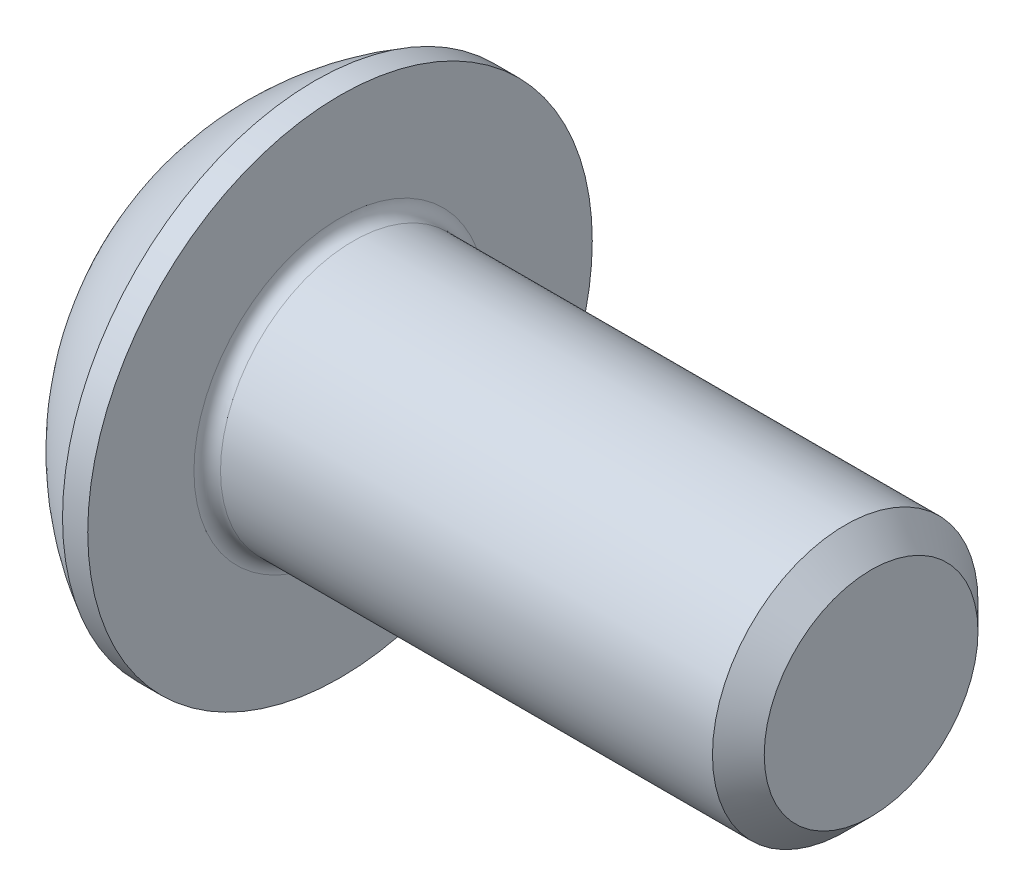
from build123d import *

# Parameters (mm, degrees)
FILLET1_R   = 0.2
HEX_2_DEPTH = 1.3


with BuildPart() as part:
    # BodySke → BaseBody (revolve)
    with BuildSketch(Plane.XY, mode=Mode.PRIVATE) as basebody_sk:
        with BuildLine():
            Line((10.2, 0), (10.2, 1.61))
            Line((10.2, 1.61), (9.81, 2))
            Line((9.81, 2), (2.2, 2))
            Line((2.2, 2), (2.2, 3.8))
            Line((2.2, 3.8), (1.82, 3.8))
            ThreePointArc((1.82, 3.8), (0.762013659, 2.991755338), (0, 1.9))
            Line((0, 1.9), (0, 0))
            Line((0, 0), (10.2, 0))
        make_face()
    revolve(basebody_sk.sketch.rotate(Axis((0, 0, 0), (1, 0, 0)), 90), axis=Axis((0, 0, 0), (1, 0, 0)))

    # Fillet1
    fillet1_edges = [part.edges().sort_by_distance(p)[0] for p in [
        (2.2, 0, -2),
    ]]
    fillet(fillet1_edges, radius=FILLET1_R)

    # Sketch2 → PreBroach (revolve, cut)
    with BuildSketch(Plane.XY, mode=Mode.PRIVATE) as prebroach_sk:
        Polygon((0, 1.25), (1.3, 1.25), (2.021687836, 0), (0, 0), align=None)
    revolve(prebroach_sk.sketch.rotate(Axis((0, 0, 0), (1, 0, 0)), 90), axis=Axis((0, 0, 0), (1, 0, 0)), mode=Mode.SUBTRACT)

    # Sketch3 → Hex 2 (cut)
    with BuildSketch(Plane(origin=(0, 0, 0), x_dir=(0, 0, -1), z_dir=(1, 0, 0))):
        Polygon((-1.25, -0.721687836), (-1.25, 0.721687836), (0, 1.443375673), (1.25, 0.721687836), (1.25, -0.721687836), (0, -1.443375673), align=None)
    extrude(amount=HEX_2_DEPTH, mode=Mode.SUBTRACT)


solid = part.part
